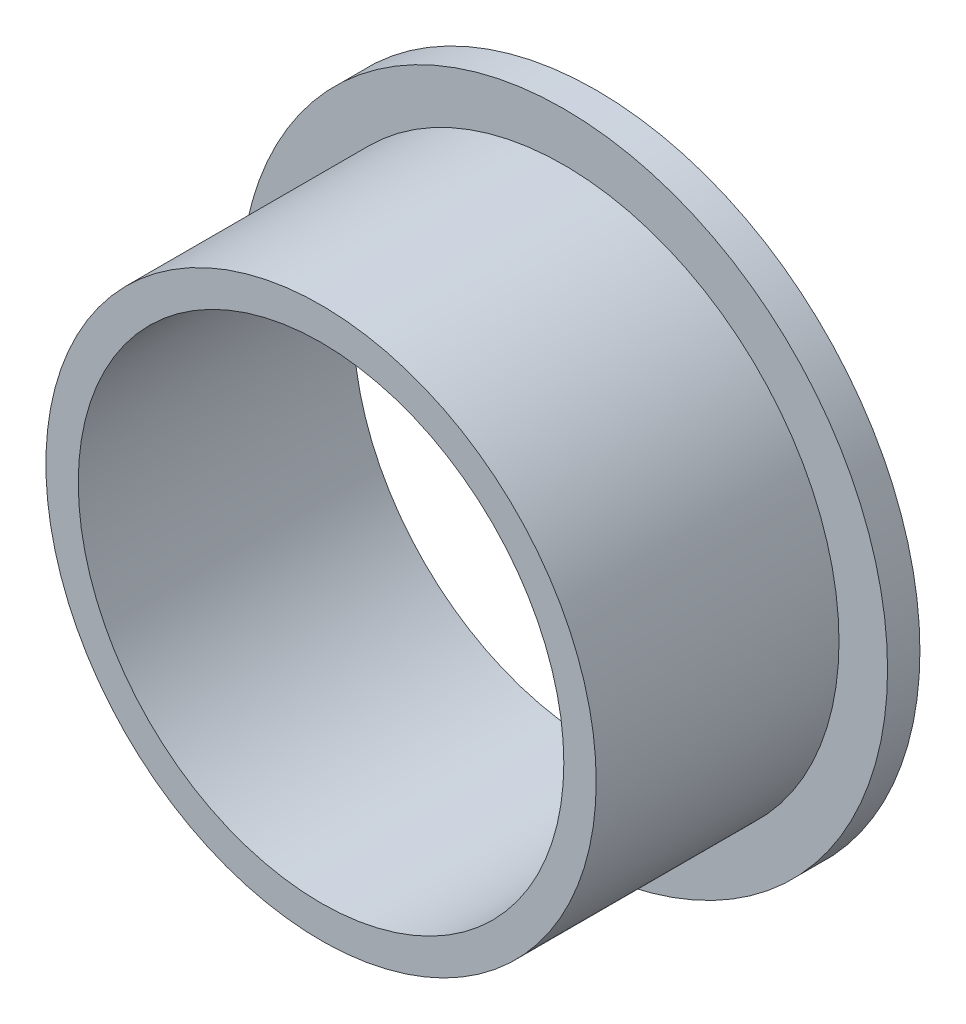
ISO-10303-21;
HEADER;
FILE_DESCRIPTION(('STEP AP214'),'2;1');
FILE_NAME('part.step','',(''),(''),'','','');
FILE_SCHEMA(('AUTOMOTIVE_DESIGN { 1 0 10303 214 1 1 1 1 }'));
ENDSEC;
DATA;
#1=APPLICATION_CONTEXT('core data for automotive mechanical design processes');
#2=APPLICATION_PROTOCOL_DEFINITION('international standard','automotive_design',2000,#1);
#3=PRODUCT_CONTEXT('',#1,'mechanical');
#4=PRODUCT('Part','Part','',(#3));
#5=PRODUCT_RELATED_PRODUCT_CATEGORY('part','',(#4));
#6=PRODUCT_DEFINITION_FORMATION('','',#4);
#7=PRODUCT_DEFINITION_CONTEXT('part definition',#1,'design');
#8=PRODUCT_DEFINITION('design','',#6,#7);
#9=PRODUCT_DEFINITION_SHAPE('','',#8);
#10=(LENGTH_UNIT() NAMED_UNIT(*) SI_UNIT(.MILLI.,.METRE.));
#11=(NAMED_UNIT(*) PLANE_ANGLE_UNIT() SI_UNIT($,.RADIAN.));
#12=(NAMED_UNIT(*) SI_UNIT($,.STERADIAN.) SOLID_ANGLE_UNIT());
#13=UNCERTAINTY_MEASURE_WITH_UNIT(LENGTH_MEASURE(1.E-05),#10,'distance_accuracy_value','');
#14=(GEOMETRIC_REPRESENTATION_CONTEXT(3) GLOBAL_UNCERTAINTY_ASSIGNED_CONTEXT((#13)) GLOBAL_UNIT_ASSIGNED_CONTEXT((#10,
#11,#12)) REPRESENTATION_CONTEXT('',''));
#15=CARTESIAN_POINT('',(0.,0.,0.));
#16=DIRECTION('',(0.,0.,1.));
#17=DIRECTION('',(1.,0.,0.));
#18=AXIS2_PLACEMENT_3D('',#15,#16,#17);
#19=CARTESIAN_POINT('',(0.,0.,-2.));
#20=DIRECTION('',(0.,0.,1.));
#21=DIRECTION('',(1.,0.,0.));
#22=AXIS2_PLACEMENT_3D('',#19,#20,#21);
#23=CYLINDRICAL_SURFACE('',#22,15.);
#24=CARTESIAN_POINT('',(0.,0.,-2.));
#25=DIRECTION('',(0.,0.,1.));
#26=DIRECTION('',(1.,0.,0.));
#27=AXIS2_PLACEMENT_3D('',#24,#25,#26);
#28=CIRCLE('',#27,15.);
#29=CARTESIAN_POINT('',(15.,0.,-2.));
#30=VERTEX_POINT('',#29);
#31=EDGE_CURVE('E44',#30,#30,#28,.T.);
#32=ORIENTED_EDGE('',*,*,#31,.F.);
#33=EDGE_LOOP('',(#32));
#34=FACE_BOUND('',#33,.T.);
#35=CARTESIAN_POINT('',(0.,0.,15.));
#36=DIRECTION('',(0.,0.,1.));
#37=DIRECTION('',(1.,0.,0.));
#38=AXIS2_PLACEMENT_3D('',#35,#36,#37);
#39=CIRCLE('',#38,15.);
#40=CARTESIAN_POINT('',(15.,0.,15.));
#41=VERTEX_POINT('',#40);
#42=EDGE_CURVE('E39',#41,#41,#39,.F.);
#43=ORIENTED_EDGE('',*,*,#42,.F.);
#44=EDGE_LOOP('',(#43));
#45=FACE_BOUND('',#44,.T.);
#46=ADVANCED_FACE('F12',(#34,#45),#23,.F.);
#47=CARTESIAN_POINT('',(20.,-20.,-2.));
#48=DIRECTION('',(0.,0.,-1.));
#49=DIRECTION('',(-1.,0.,0.));
#50=AXIS2_PLACEMENT_3D('',#47,#48,#49);
#51=PLANE('',#50);
#52=ORIENTED_EDGE('',*,*,#31,.T.);
#53=EDGE_LOOP('',(#52));
#54=FACE_BOUND('',#53,.T.);
#55=CARTESIAN_POINT('',(0.,0.,-2.));
#56=DIRECTION('',(0.,0.,1.));
#57=DIRECTION('',(1.,0.,0.));
#58=AXIS2_PLACEMENT_3D('',#55,#56,#57);
#59=CIRCLE('',#58,20.);
#60=CARTESIAN_POINT('',(20.,0.,-2.));
#61=VERTEX_POINT('',#60);
#62=EDGE_CURVE('E34',#61,#61,#59,.F.);
#63=ORIENTED_EDGE('',*,*,#62,.T.);
#64=EDGE_LOOP('',(#63));
#65=FACE_BOUND('',#64,.T.);
#66=ADVANCED_FACE('F49',(#54,#65),#51,.T.);
#67=CARTESIAN_POINT('',(-17.,-17.,15.));
#68=DIRECTION('',(0.,0.,1.));
#69=DIRECTION('',(1.,0.,0.));
#70=AXIS2_PLACEMENT_3D('',#67,#68,#69);
#71=PLANE('',#70);
#72=ORIENTED_EDGE('',*,*,#42,.T.);
#73=EDGE_LOOP('',(#72));
#74=FACE_BOUND('',#73,.T.);
#75=CARTESIAN_POINT('',(0.,0.,15.));
#76=DIRECTION('',(0.,0.,1.));
#77=DIRECTION('',(1.,0.,0.));
#78=AXIS2_PLACEMENT_3D('',#75,#76,#77);
#79=CIRCLE('',#78,17.);
#80=CARTESIAN_POINT('',(17.,0.,15.));
#81=VERTEX_POINT('',#80);
#82=EDGE_CURVE('E25',#81,#81,#79,.T.);
#83=ORIENTED_EDGE('',*,*,#82,.T.);
#84=EDGE_LOOP('',(#83));
#85=FACE_BOUND('',#84,.T.);
#86=ADVANCED_FACE('F57',(#74,#85),#71,.T.);
#87=CARTESIAN_POINT('',(0.,0.,-2.));
#88=DIRECTION('',(0.,0.,1.));
#89=DIRECTION('',(1.,0.,0.));
#90=AXIS2_PLACEMENT_3D('',#87,#88,#89);
#91=CYLINDRICAL_SURFACE('',#90,20.);
#92=ORIENTED_EDGE('',*,*,#62,.F.);
#93=EDGE_LOOP('',(#92));
#94=FACE_BOUND('',#93,.T.);
#95=CARTESIAN_POINT('',(0.,0.,0.));
#96=DIRECTION('',(0.,0.,1.));
#97=DIRECTION('',(1.,0.,0.));
#98=AXIS2_PLACEMENT_3D('',#95,#96,#97);
#99=CIRCLE('',#98,20.);
#100=CARTESIAN_POINT('',(20.,0.,0.));
#101=VERTEX_POINT('',#100);
#102=EDGE_CURVE('E20',#101,#101,#99,.T.);
#103=ORIENTED_EDGE('',*,*,#102,.F.);
#104=EDGE_LOOP('',(#103));
#105=FACE_BOUND('',#104,.T.);
#106=ADVANCED_FACE('F60',(#94,#105),#91,.T.);
#107=CARTESIAN_POINT('',(0.,0.,0.));
#108=DIRECTION('',(0.,0.,1.));
#109=DIRECTION('',(1.,0.,0.));
#110=AXIS2_PLACEMENT_3D('',#107,#108,#109);
#111=CYLINDRICAL_SURFACE('',#110,17.);
#112=CARTESIAN_POINT('',(0.,0.,0.));
#113=DIRECTION('',(0.,0.,1.));
#114=DIRECTION('',(1.,0.,0.));
#115=AXIS2_PLACEMENT_3D('',#112,#113,#114);
#116=CIRCLE('',#115,17.);
#117=CARTESIAN_POINT('',(17.,0.,0.));
#118=VERTEX_POINT('',#117);
#119=EDGE_CURVE('E8',#118,#118,#116,.F.);
#120=ORIENTED_EDGE('',*,*,#119,.F.);
#121=EDGE_LOOP('',(#120));
#122=FACE_BOUND('',#121,.T.);
#123=ORIENTED_EDGE('',*,*,#82,.F.);
#124=EDGE_LOOP('',(#123));
#125=FACE_BOUND('',#124,.T.);
#126=ADVANCED_FACE('F63',(#122,#125),#111,.T.);
#127=CARTESIAN_POINT('',(-20.,-20.,0.));
#128=DIRECTION('',(0.,0.,1.));
#129=DIRECTION('',(1.,0.,0.));
#130=AXIS2_PLACEMENT_3D('',#127,#128,#129);
#131=PLANE('',#130);
#132=ORIENTED_EDGE('',*,*,#119,.T.);
#133=EDGE_LOOP('',(#132));
#134=FACE_BOUND('',#133,.T.);
#135=ORIENTED_EDGE('',*,*,#102,.T.);
#136=EDGE_LOOP('',(#135));
#137=FACE_BOUND('',#136,.T.);
#138=ADVANCED_FACE('F14',(#134,#137),#131,.T.);
#139=CLOSED_SHELL('',(#46,#66,#86,#106,#126,#138));
#140=MANIFOLD_SOLID_BREP('B1',#139);
#141=ADVANCED_BREP_SHAPE_REPRESENTATION('',(#18,#140),#14);
#142=SHAPE_DEFINITION_REPRESENTATION(#9,#141);
ENDSEC;
END-ISO-10303-21;
